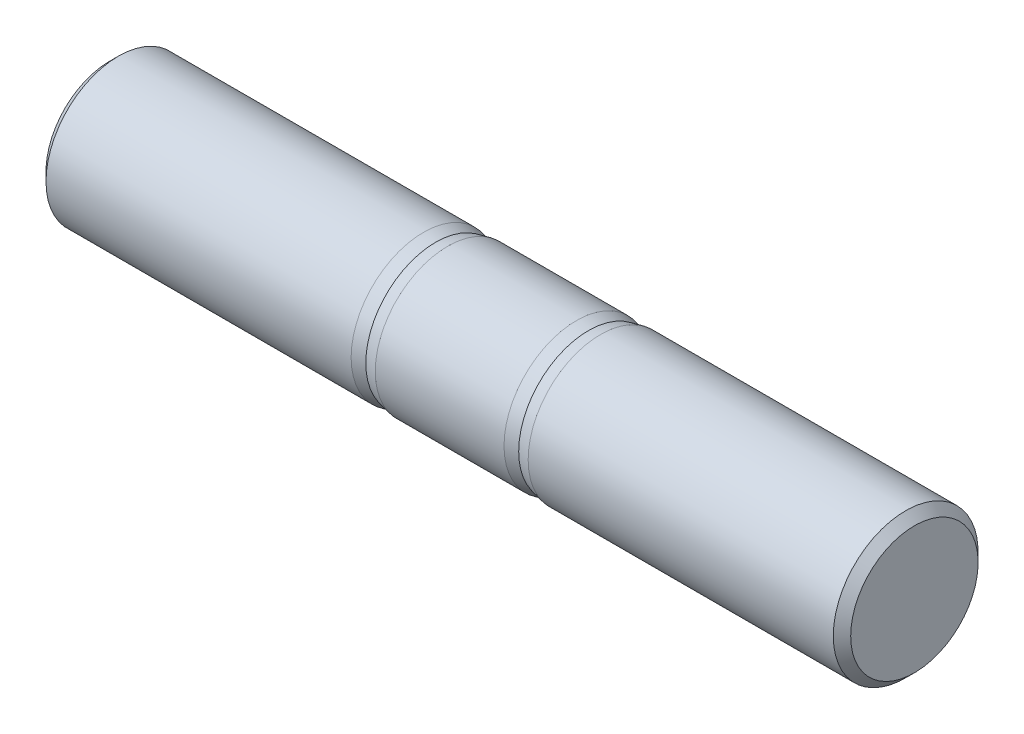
ISO-10303-21;
HEADER;
FILE_DESCRIPTION(('STEP AP214'),'2;1');
FILE_NAME('part.step','',(''),(''),'','','');
FILE_SCHEMA(('AUTOMOTIVE_DESIGN { 1 0 10303 214 1 1 1 1 }'));
ENDSEC;
DATA;
#1=APPLICATION_CONTEXT('core data for automotive mechanical design processes');
#2=APPLICATION_PROTOCOL_DEFINITION('international standard','automotive_design',2000,#1);
#3=PRODUCT_CONTEXT('',#1,'mechanical');
#4=PRODUCT('Part','Part','',(#3));
#5=PRODUCT_RELATED_PRODUCT_CATEGORY('part','',(#4));
#6=PRODUCT_DEFINITION_FORMATION('','',#4);
#7=PRODUCT_DEFINITION_CONTEXT('part definition',#1,'design');
#8=PRODUCT_DEFINITION('design','',#6,#7);
#9=PRODUCT_DEFINITION_SHAPE('','',#8);
#10=(LENGTH_UNIT() NAMED_UNIT(*) SI_UNIT(.MILLI.,.METRE.));
#11=(NAMED_UNIT(*) PLANE_ANGLE_UNIT() SI_UNIT($,.RADIAN.));
#12=(NAMED_UNIT(*) SI_UNIT($,.STERADIAN.) SOLID_ANGLE_UNIT());
#13=UNCERTAINTY_MEASURE_WITH_UNIT(LENGTH_MEASURE(1.E-05),#10,'distance_accuracy_value','');
#14=(GEOMETRIC_REPRESENTATION_CONTEXT(3) GLOBAL_UNCERTAINTY_ASSIGNED_CONTEXT((#13)) GLOBAL_UNIT_ASSIGNED_CONTEXT((#10,
#11,#12)) REPRESENTATION_CONTEXT('',''));
#15=CARTESIAN_POINT('',(0.,0.,0.));
#16=DIRECTION('',(0.,0.,1.));
#17=DIRECTION('',(1.,0.,0.));
#18=AXIS2_PLACEMENT_3D('',#15,#16,#17);
#19=CARTESIAN_POINT('',(84.,0.,0.));
#20=DIRECTION('',(-1.,0.,0.));
#21=DIRECTION('',(0.,0.,1.));
#22=AXIS2_PLACEMENT_3D('',#19,#20,#21);
#23=CONICAL_SURFACE('',#22,16.701,0.213209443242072);
#24=CARTESIAN_POINT('',(78.,0.,0.));
#25=DIRECTION('',(-1.,0.,0.));
#26=DIRECTION('',(0.,0.,1.));
#27=AXIS2_PLACEMENT_3D('',#24,#25,#26);
#28=CIRCLE('',#27,18.);
#29=CARTESIAN_POINT('',(78.,0.,18.));
#30=VERTEX_POINT('',#29);
#31=EDGE_CURVE('E69',#30,#30,#28,.T.);
#32=ORIENTED_EDGE('',*,*,#31,.F.);
#33=EDGE_LOOP('',(#32));
#34=FACE_BOUND('',#33,.T.);
#35=CARTESIAN_POINT('',(81.,0.,0.));
#36=DIRECTION('',(1.,0.,0.));
#37=DIRECTION('',(0.,0.,-1.));
#38=AXIS2_PLACEMENT_3D('',#35,#36,#37);
#39=CIRCLE('',#38,17.3505);
#40=CARTESIAN_POINT('',(81.,0.,-17.3505));
#41=VERTEX_POINT('',#40);
#42=EDGE_CURVE('E10',#41,#41,#39,.T.);
#43=ORIENTED_EDGE('',*,*,#42,.F.);
#44=EDGE_LOOP('',(#43));
#45=FACE_BOUND('',#44,.T.);
#46=ADVANCED_FACE('F43',(#34,#45),#23,.T.);
#47=CARTESIAN_POINT('',(0.,0.,0.));
#48=DIRECTION('',(1.,0.,0.));
#49=DIRECTION('',(0.,0.,-1.));
#50=AXIS2_PLACEMENT_3D('',#47,#48,#49);
#51=PLANE('',#50);
#52=CARTESIAN_POINT('',(0.,0.,0.));
#53=DIRECTION('',(1.,0.,0.));
#54=DIRECTION('',(0.,0.,-1.));
#55=AXIS2_PLACEMENT_3D('',#52,#53,#54);
#56=CIRCLE('',#55,15.835);
#57=CARTESIAN_POINT('',(0.,0.,-15.835));
#58=VERTEX_POINT('',#57);
#59=EDGE_CURVE('E66',#58,#58,#56,.F.);
#60=ORIENTED_EDGE('',*,*,#59,.T.);
#61=EDGE_LOOP('',(#60));
#62=FACE_BOUND('',#61,.T.);
#63=ADVANCED_FACE('F99',(#62),#51,.F.);
#64=CARTESIAN_POINT('',(-1.31084166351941,0.,0.));
#65=DIRECTION('',(-1.,0.,0.));
#66=DIRECTION('',(0.,0.,1.));
#67=AXIS2_PLACEMENT_3D('',#64,#65,#66);
#68=CYLINDRICAL_SURFACE('',#67,18.);
#69=CARTESIAN_POINT('',(2.16500000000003,0.,0.));
#70=DIRECTION('',(1.,0.,0.));
#71=DIRECTION('',(0.,0.,-1.));
#72=AXIS2_PLACEMENT_3D('',#69,#70,#71);
#73=CIRCLE('',#72,18.);
#74=CARTESIAN_POINT('',(2.16500000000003,0.,-18.));
#75=VERTEX_POINT('',#74);
#76=EDGE_CURVE('E63',#75,#75,#73,.T.);
#77=ORIENTED_EDGE('',*,*,#76,.T.);
#78=EDGE_LOOP('',(#77));
#79=FACE_BOUND('',#78,.T.);
#80=ORIENTED_EDGE('',*,*,#31,.T.);
#81=EDGE_LOOP('',(#80));
#82=FACE_BOUND('',#81,.T.);
#83=ADVANCED_FACE('F106',(#79,#82),#68,.T.);
#84=CARTESIAN_POINT('',(0.,0.,0.));
#85=DIRECTION('',(1.,0.,0.));
#86=DIRECTION('',(0.,0.,-1.));
#87=AXIS2_PLACEMENT_3D('',#84,#85,#86);
#88=CONICAL_SURFACE('',#87,15.835,0.785398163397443);
#89=ORIENTED_EDGE('',*,*,#76,.F.);
#90=EDGE_LOOP('',(#89));
#91=FACE_BOUND('',#90,.T.);
#92=ORIENTED_EDGE('',*,*,#59,.F.);
#93=EDGE_LOOP('',(#92));
#94=FACE_BOUND('',#93,.T.);
#95=ADVANCED_FACE('F95',(#91,#94),#88,.T.);
#96=CARTESIAN_POINT('',(84.,0.,0.));
#97=DIRECTION('',(1.,0.,0.));
#98=DIRECTION('',(0.,0.,-1.));
#99=AXIS2_PLACEMENT_3D('',#96,#97,#98);
#100=CONICAL_SURFACE('',#99,18.,0.213209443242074);
#101=CARTESIAN_POINT('',(84.,0.,0.));
#102=DIRECTION('',(-1.,0.,0.));
#103=DIRECTION('',(0.,0.,1.));
#104=AXIS2_PLACEMENT_3D('',#101,#102,#103);
#105=CIRCLE('',#104,18.);
#106=CARTESIAN_POINT('',(84.,0.,18.));
#107=VERTEX_POINT('',#106);
#108=EDGE_CURVE('E75',#107,#107,#105,.T.);
#109=ORIENTED_EDGE('',*,*,#108,.T.);
#110=EDGE_LOOP('',(#109));
#111=FACE_BOUND('',#110,.T.);
#112=ORIENTED_EDGE('',*,*,#42,.T.);
#113=EDGE_LOOP('',(#112));
#114=FACE_BOUND('',#113,.T.);
#115=ADVANCED_FACE('F86',(#111,#114),#100,.T.);
#116=CARTESIAN_POINT('',(122.,0.,0.));
#117=DIRECTION('',(-1.,0.,0.));
#118=DIRECTION('',(0.,0.,1.));
#119=AXIS2_PLACEMENT_3D('',#116,#117,#118);
#120=CONICAL_SURFACE('',#119,16.701,0.213209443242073);
#121=CARTESIAN_POINT('',(116.,0.,0.));
#122=DIRECTION('',(-1.,0.,0.));
#123=DIRECTION('',(0.,0.,1.));
#124=AXIS2_PLACEMENT_3D('',#121,#122,#123);
#125=CIRCLE('',#124,18.);
#126=CARTESIAN_POINT('',(116.,0.,18.));
#127=VERTEX_POINT('',#126);
#128=EDGE_CURVE('E78',#127,#127,#125,.T.);
#129=ORIENTED_EDGE('',*,*,#128,.F.);
#130=EDGE_LOOP('',(#129));
#131=FACE_BOUND('',#130,.T.);
#132=CARTESIAN_POINT('',(119.,0.,0.));
#133=DIRECTION('',(-1.,0.,0.));
#134=DIRECTION('',(0.,0.,1.));
#135=AXIS2_PLACEMENT_3D('',#132,#133,#134);
#136=CIRCLE('',#135,17.3505);
#137=CARTESIAN_POINT('',(119.,0.,17.3505));
#138=VERTEX_POINT('',#137);
#139=EDGE_CURVE('E50',#138,#138,#136,.T.);
#140=ORIENTED_EDGE('',*,*,#139,.T.);
#141=EDGE_LOOP('',(#140));
#142=FACE_BOUND('',#141,.T.);
#143=ADVANCED_FACE('F84',(#131,#142),#120,.T.);
#144=CARTESIAN_POINT('',(-7.80908694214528,0.,0.));
#145=DIRECTION('',(-1.,0.,0.));
#146=DIRECTION('',(0.,0.,1.));
#147=AXIS2_PLACEMENT_3D('',#144,#145,#146);
#148=CYLINDRICAL_SURFACE('',#147,18.);
#149=ORIENTED_EDGE('',*,*,#108,.F.);
#150=EDGE_LOOP('',(#149));
#151=FACE_BOUND('',#150,.T.);
#152=ORIENTED_EDGE('',*,*,#128,.T.);
#153=EDGE_LOOP('',(#152));
#154=FACE_BOUND('',#153,.T.);
#155=ADVANCED_FACE('F82',(#151,#154),#148,.T.);
#156=CARTESIAN_POINT('',(200.,18.,0.));
#157=DIRECTION('',(-1.,0.,0.));
#158=DIRECTION('',(0.,0.,1.));
#159=AXIS2_PLACEMENT_3D('',#156,#157,#158);
#160=PLANE('',#159);
#161=CARTESIAN_POINT('',(200.,0.,0.));
#162=DIRECTION('',(-1.,0.,0.));
#163=DIRECTION('',(0.,0.,1.));
#164=AXIS2_PLACEMENT_3D('',#161,#162,#163);
#165=CIRCLE('',#164,15.8350000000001);
#166=CARTESIAN_POINT('',(200.,0.,15.8350000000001));
#167=VERTEX_POINT('',#166);
#168=EDGE_CURVE('E54',#167,#167,#165,.F.);
#169=ORIENTED_EDGE('',*,*,#168,.T.);
#170=EDGE_LOOP('',(#169));
#171=FACE_BOUND('',#170,.T.);
#172=ADVANCED_FACE('F92',(#171),#160,.F.);
#173=CARTESIAN_POINT('',(197.835,0.,0.));
#174=DIRECTION('',(-1.,0.,0.));
#175=DIRECTION('',(0.,0.,1.));
#176=AXIS2_PLACEMENT_3D('',#173,#174,#175);
#177=CONICAL_SURFACE('',#176,18.,0.785398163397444);
#178=ORIENTED_EDGE('',*,*,#168,.F.);
#179=EDGE_LOOP('',(#178));
#180=FACE_BOUND('',#179,.T.);
#181=CARTESIAN_POINT('',(197.835,0.,0.));
#182=DIRECTION('',(-1.,0.,0.));
#183=DIRECTION('',(0.,0.,1.));
#184=AXIS2_PLACEMENT_3D('',#181,#182,#183);
#185=CIRCLE('',#184,18.);
#186=CARTESIAN_POINT('',(197.835,0.,18.));
#187=VERTEX_POINT('',#186);
#188=EDGE_CURVE('E58',#187,#187,#185,.T.);
#189=ORIENTED_EDGE('',*,*,#188,.F.);
#190=EDGE_LOOP('',(#189));
#191=FACE_BOUND('',#190,.T.);
#192=ADVANCED_FACE('F45',(#180,#191),#177,.T.);
#193=CARTESIAN_POINT('',(-1.31084166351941,0.,0.));
#194=DIRECTION('',(-1.,0.,0.));
#195=DIRECTION('',(0.,0.,1.));
#196=AXIS2_PLACEMENT_3D('',#193,#194,#195);
#197=CYLINDRICAL_SURFACE('',#196,18.);
#198=ORIENTED_EDGE('',*,*,#188,.T.);
#199=EDGE_LOOP('',(#198));
#200=FACE_BOUND('',#199,.T.);
#201=CARTESIAN_POINT('',(122.,0.,0.));
#202=DIRECTION('',(-1.,0.,0.));
#203=DIRECTION('',(0.,0.,1.));
#204=AXIS2_PLACEMENT_3D('',#201,#202,#203);
#205=CIRCLE('',#204,18.);
#206=CARTESIAN_POINT('',(122.,0.,18.));
#207=VERTEX_POINT('',#206);
#208=EDGE_CURVE('E72',#207,#207,#205,.T.);
#209=ORIENTED_EDGE('',*,*,#208,.F.);
#210=EDGE_LOOP('',(#209));
#211=FACE_BOUND('',#210,.T.);
#212=ADVANCED_FACE('F134',(#200,#211),#197,.T.);
#213=CARTESIAN_POINT('',(122.,0.,0.));
#214=DIRECTION('',(1.,0.,0.));
#215=DIRECTION('',(0.,0.,-1.));
#216=AXIS2_PLACEMENT_3D('',#213,#214,#215);
#217=CONICAL_SURFACE('',#216,18.,0.213209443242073);
#218=ORIENTED_EDGE('',*,*,#208,.T.);
#219=EDGE_LOOP('',(#218));
#220=FACE_BOUND('',#219,.T.);
#221=ORIENTED_EDGE('',*,*,#139,.F.);
#222=EDGE_LOOP('',(#221));
#223=FACE_BOUND('',#222,.T.);
#224=ADVANCED_FACE('F113',(#220,#223),#217,.T.);
#225=CLOSED_SHELL('',(#46,#63,#83,#95,#115,#143,#155,#172,#192,#212,#224));
#226=MANIFOLD_SOLID_BREP('B2',#225);
#227=ADVANCED_BREP_SHAPE_REPRESENTATION('',(#18,#226),#14);
#228=SHAPE_DEFINITION_REPRESENTATION(#9,#227);
ENDSEC;
END-ISO-10303-21;
